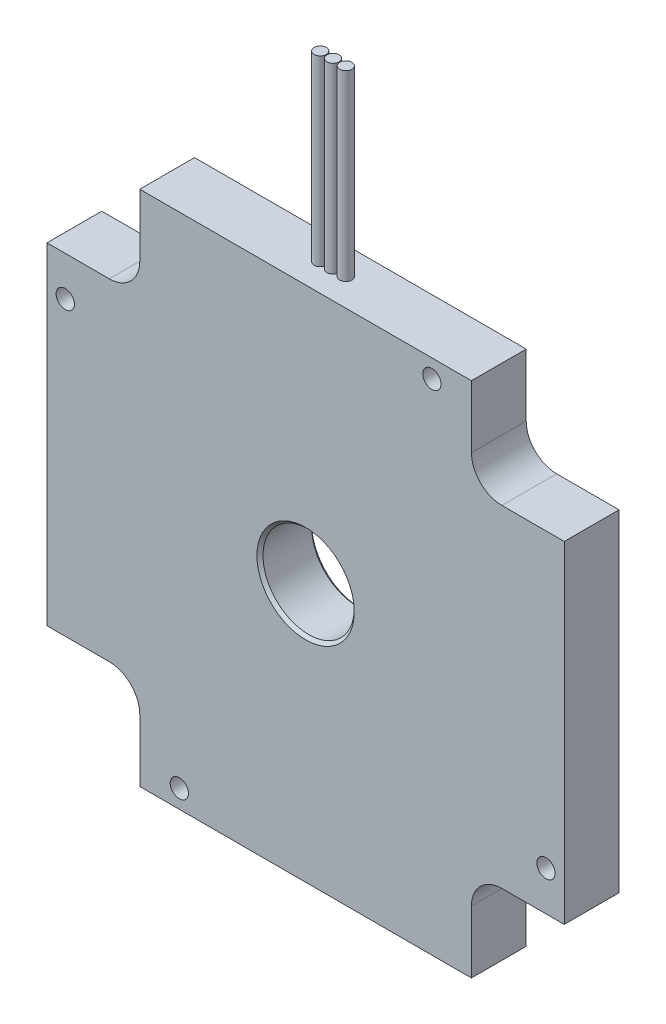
from build123d import *

# Parameters (mm, degrees)
EXTRUDE_1_DEPTH     = 9
SKETCH_2_R          = 7.5
CUT_EXTRUDE_1_DEPTH = 61.774172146
CHAMFER_2_SIZE      = 0.5
SKETCH_3_R          = 1.5
CUT_EXTRUDE_2_DEPTH = 61.774172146
FILLET_2_R          = 5
SKETCH_4_R          = 1
EXTRUDE_2_DEPTH     = 30


with BuildPart() as part:
    # Sketch 1 → Extrude 1 (new body)
    with BuildSketch(Plane.XY):
        Polygon((-27.25, 27.25), (-27.25, 42.5), (27.25, 42.5), (27.25, 27.25), (42.5, 27.25), (42.5, -27.25), (27.25, -27.25), (27.25, -42.5), (-27.25, -42.5), (-27.25, -27.25), (-42.5, -27.25), (-42.5, 27.25), align=None)
    extrude(amount=EXTRUDE_1_DEPTH)

    # Sketch 2 → Cut-Extrude 1 (cut, through all)
    with BuildSketch(Plane.XY.offset(9)):
        Circle(SKETCH_2_R)
    extrude(amount=-CUT_EXTRUDE_1_DEPTH, mode=Mode.SUBTRACT)

    # Chamfer 2
    chamfer_2_edges = [part.edges().sort_by_distance(p)[0] for p in [
        (-7.5, 0, 0),
        (-7.5, 0, 9),
    ]]
    chamfer(chamfer_2_edges, length=CHAMFER_2_SIZE)

    # Sketch 3 → Cut-Extrude 2 (cut, through all)
    with BuildSketch(Plane.XY.offset(9)):
        with Locations((-39.497747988, 20.75)):
            Circle(SKETCH_3_R)
        with Locations((-20.75, -39.5)):
            Circle(SKETCH_3_R)
        with Locations((39.5, -20.75)):
            Circle(SKETCH_3_R)
        with Locations((20.75, 39.5)):
            Circle(SKETCH_3_R)
    extrude(amount=-CUT_EXTRUDE_2_DEPTH, mode=Mode.SUBTRACT)

    # Fillet 2
    fillet_2_edges = [part.edges().sort_by_distance(p)[0] for p in [
        (27.25, -27.25, 4.5),
        (-27.25, -27.25, 4.5),
        (-27.25, 27.25, 4.5),
        (27.25, 27.25, 4.5),
    ]]
    fillet(fillet_2_edges, radius=FILLET_2_R)

    # Sketch 4 → Extrude 2 (add)
    with BuildSketch(Plane(origin=(0, 42.5, 0), x_dir=(1, 0, 0), z_dir=(0, 1, 0))):
        with Locations((0, -4.5)):
            Circle(SKETCH_4_R)
        with Locations((-2.1, -4.5)):
            Circle(SKETCH_4_R)
        with Locations((2.1, -4.5)):
            Circle(SKETCH_4_R)
    extrude(amount=EXTRUDE_2_DEPTH)


solid = part.part
